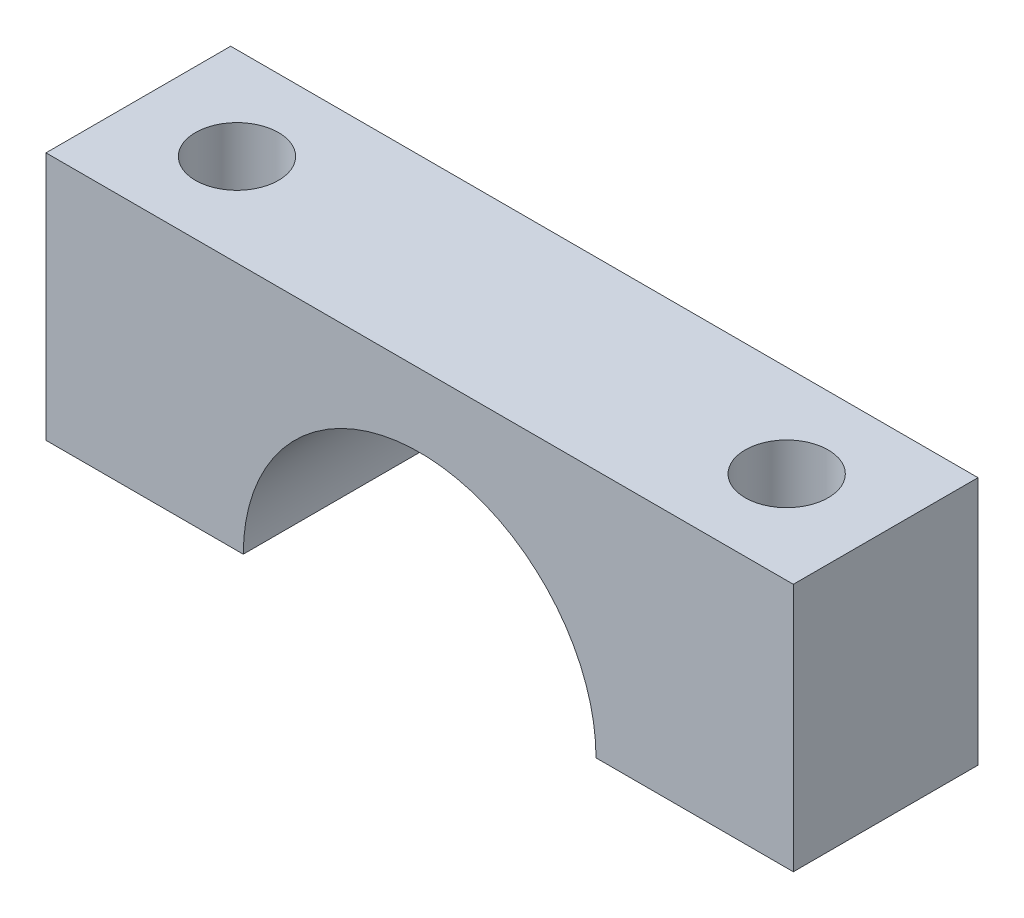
ISO-10303-21;
HEADER;
FILE_DESCRIPTION(('STEP AP214'),'2;1');
FILE_NAME('part.step','',(''),(''),'','','');
FILE_SCHEMA(('AUTOMOTIVE_DESIGN { 1 0 10303 214 1 1 1 1 }'));
ENDSEC;
DATA;
#1=APPLICATION_CONTEXT('core data for automotive mechanical design processes');
#2=APPLICATION_PROTOCOL_DEFINITION('international standard','automotive_design',2000,#1);
#3=PRODUCT_CONTEXT('',#1,'mechanical');
#4=PRODUCT('Part','Part','',(#3));
#5=PRODUCT_RELATED_PRODUCT_CATEGORY('part','',(#4));
#6=PRODUCT_DEFINITION_FORMATION('','',#4);
#7=PRODUCT_DEFINITION_CONTEXT('part definition',#1,'design');
#8=PRODUCT_DEFINITION('design','',#6,#7);
#9=PRODUCT_DEFINITION_SHAPE('','',#8);
#10=(LENGTH_UNIT() NAMED_UNIT(*) SI_UNIT(.MILLI.,.METRE.));
#11=(NAMED_UNIT(*) PLANE_ANGLE_UNIT() SI_UNIT($,.RADIAN.));
#12=(NAMED_UNIT(*) SI_UNIT($,.STERADIAN.) SOLID_ANGLE_UNIT());
#13=UNCERTAINTY_MEASURE_WITH_UNIT(LENGTH_MEASURE(1.E-05),#10,'distance_accuracy_value','');
#14=(GEOMETRIC_REPRESENTATION_CONTEXT(3) GLOBAL_UNCERTAINTY_ASSIGNED_CONTEXT((#13)) GLOBAL_UNIT_ASSIGNED_CONTEXT((#10,
#11,#12)) REPRESENTATION_CONTEXT('',''));
#15=CARTESIAN_POINT('',(0.,0.,0.));
#16=DIRECTION('',(0.,0.,1.));
#17=DIRECTION('',(1.,0.,0.));
#18=AXIS2_PLACEMENT_3D('',#15,#16,#17);
#19=CARTESIAN_POINT('',(0.,0.,44.5));
#20=DIRECTION('',(0.,1.,0.));
#21=DIRECTION('',(0.,0.,1.));
#22=AXIS2_PLACEMENT_3D('',#19,#20,#21);
#23=PLANE('',#22);
#24=CARTESIAN_POINT('',(23.77,0.,22.25));
#25=DIRECTION('',(0.,1.,0.));
#26=DIRECTION('',(0.,0.,1.));
#27=AXIS2_PLACEMENT_3D('',#24,#25,#26);
#28=CIRCLE('',#27,4.49999999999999);
#29=CARTESIAN_POINT('',(23.77,0.,26.75));
#30=VERTEX_POINT('',#29);
#31=EDGE_CURVE('E136',#30,#30,#28,.T.);
#32=ORIENTED_EDGE('',*,*,#31,.T.);
#33=EDGE_LOOP('',(#32));
#34=FACE_BOUND('',#33,.T.);
#35=DIRECTION('',(1.,0.,0.));
#36=VECTOR('',#35,1.);
#37=CARTESIAN_POINT('',(0.,0.,0.));
#38=LINE('',#37,#36);
#39=CARTESIAN_POINT('',(0.,0.,0.));
#40=VERTEX_POINT('',#39);
#41=CARTESIAN_POINT('',(47.54,0.,0.));
#42=VERTEX_POINT('',#41);
#43=EDGE_CURVE('E132',#40,#42,#38,.T.);
#44=ORIENTED_EDGE('',*,*,#43,.T.);
#45=DIRECTION('',(0.,0.,-1.));
#46=VECTOR('',#45,1.);
#47=CARTESIAN_POINT('',(47.54,0.,44.5));
#48=LINE('',#47,#46);
#49=CARTESIAN_POINT('',(47.54,0.,44.5));
#50=VERTEX_POINT('',#49);
#51=EDGE_CURVE('E11',#50,#42,#48,.T.);
#52=ORIENTED_EDGE('',*,*,#51,.F.);
#53=DIRECTION('',(1.,0.,0.));
#54=VECTOR('',#53,1.);
#55=CARTESIAN_POINT('',(0.,0.,44.5));
#56=LINE('',#55,#54);
#57=CARTESIAN_POINT('',(0.,0.,44.5));
#58=VERTEX_POINT('',#57);
#59=EDGE_CURVE('E144',#58,#50,#56,.T.);
#60=ORIENTED_EDGE('',*,*,#59,.F.);
#61=DIRECTION('',(0.,0.,-1.));
#62=VECTOR('',#61,1.);
#63=CARTESIAN_POINT('',(0.,0.,44.5));
#64=LINE('',#63,#62);
#65=EDGE_CURVE('E128',#58,#40,#64,.T.);
#66=ORIENTED_EDGE('',*,*,#65,.T.);
#67=EDGE_LOOP('',(#44,#52,#60,#66));
#68=FACE_BOUND('',#67,.T.);
#69=ADVANCED_FACE('F37',(#34,#68),#23,.F.);
#70=CARTESIAN_POINT('',(90.04,0.,44.5));
#71=DIRECTION('',(0.,0.,-1.));
#72=DIRECTION('',(-1.,0.,0.));
#73=AXIS2_PLACEMENT_3D('',#70,#71,#72);
#74=CYLINDRICAL_SURFACE('',#73,42.5);
#75=DIRECTION('',(0.,0.,-1.));
#76=VECTOR('',#75,1.);
#77=CARTESIAN_POINT('',(72.0787238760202,38.5180809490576,27.25));
#78=LINE('',#77,#76);
#79=CARTESIAN_POINT('',(72.0787238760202,38.5180809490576,27.25));
#80=VERTEX_POINT('',#79);
#81=CARTESIAN_POINT('',(72.0787238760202,38.5180809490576,17.25));
#82=VERTEX_POINT('',#81);
#83=EDGE_CURVE('E187',#80,#82,#78,.T.);
#84=ORIENTED_EDGE('',*,*,#83,.F.);
#85=CARTESIAN_POINT('',(90.04,0.,27.25));
#86=DIRECTION('',(0.,0.,-1.));
#87=DIRECTION('',(1.,0.,0.));
#88=AXIS2_PLACEMENT_3D('',#85,#86,#87);
#89=CIRCLE('',#88,42.5);
#90=CARTESIAN_POINT('',(108.00127612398,38.5180809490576,27.25));
#91=VERTEX_POINT('',#90);
#92=EDGE_CURVE('E198',#80,#91,#89,.T.);
#93=ORIENTED_EDGE('',*,*,#92,.T.);
#94=DIRECTION('',(0.,0.,-1.));
#95=VECTOR('',#94,1.);
#96=CARTESIAN_POINT('',(108.00127612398,38.5180809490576,27.25));
#97=LINE('',#96,#95);
#98=CARTESIAN_POINT('',(108.00127612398,38.5180809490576,17.25));
#99=VERTEX_POINT('',#98);
#100=EDGE_CURVE('E189',#91,#99,#97,.T.);
#101=ORIENTED_EDGE('',*,*,#100,.T.);
#102=CARTESIAN_POINT('',(90.04,0.,17.25));
#103=DIRECTION('',(0.,0.,-1.));
#104=DIRECTION('',(1.,0.,0.));
#105=AXIS2_PLACEMENT_3D('',#102,#103,#104);
#106=CIRCLE('',#105,42.5);
#107=EDGE_CURVE('E210',#82,#99,#106,.T.);
#108=ORIENTED_EDGE('',*,*,#107,.F.);
#109=EDGE_LOOP('',(#84,#93,#101,#108));
#110=FACE_BOUND('',#109,.T.);
#111=CARTESIAN_POINT('',(90.04,0.,0.));
#112=DIRECTION('',(0.,0.,-1.));
#113=DIRECTION('',(1.,0.,0.));
#114=AXIS2_PLACEMENT_3D('',#111,#112,#113);
#115=CIRCLE('',#114,42.5);
#116=CARTESIAN_POINT('',(132.54,0.,0.));
#117=VERTEX_POINT('',#116);
#118=EDGE_CURVE('E135',#42,#117,#115,.T.);
#119=ORIENTED_EDGE('',*,*,#118,.T.);
#120=DIRECTION('',(0.,0.,-1.));
#121=VECTOR('',#120,1.);
#122=CARTESIAN_POINT('',(132.54,0.,44.5));
#123=LINE('',#122,#121);
#124=CARTESIAN_POINT('',(132.54,0.,44.5));
#125=VERTEX_POINT('',#124);
#126=EDGE_CURVE('E44',#125,#117,#123,.T.);
#127=ORIENTED_EDGE('',*,*,#126,.F.);
#128=CARTESIAN_POINT('',(90.04,0.,44.5));
#129=DIRECTION('',(0.,0.,-1.));
#130=DIRECTION('',(1.,0.,0.));
#131=AXIS2_PLACEMENT_3D('',#128,#129,#130);
#132=CIRCLE('',#131,42.5);
#133=EDGE_CURVE('E95',#50,#125,#132,.T.);
#134=ORIENTED_EDGE('',*,*,#133,.F.);
#135=ORIENTED_EDGE('',*,*,#51,.T.);
#136=EDGE_LOOP('',(#119,#127,#134,#135));
#137=FACE_BOUND('',#136,.T.);
#138=ADVANCED_FACE('F243',(#110,#137),#74,.F.);
#139=CARTESIAN_POINT('',(180.08,0.,44.5));
#140=DIRECTION('',(0.,1.,0.));
#141=DIRECTION('',(-1.,0.,0.));
#142=AXIS2_PLACEMENT_3D('',#139,#140,#141);
#143=PLANE('',#142);
#144=CARTESIAN_POINT('',(156.23,0.,22.25));
#145=DIRECTION('',(0.,1.,0.));
#146=DIRECTION('',(0.,0.,1.));
#147=AXIS2_PLACEMENT_3D('',#144,#145,#146);
#148=CIRCLE('',#147,4.49999999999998);
#149=CARTESIAN_POINT('',(156.23,0.,26.75));
#150=VERTEX_POINT('',#149);
#151=EDGE_CURVE('E172',#150,#150,#148,.T.);
#152=ORIENTED_EDGE('',*,*,#151,.T.);
#153=EDGE_LOOP('',(#152));
#154=FACE_BOUND('',#153,.T.);
#155=DIRECTION('',(1.,0.,0.));
#156=VECTOR('',#155,1.);
#157=CARTESIAN_POINT('',(180.08,0.,0.));
#158=LINE('',#157,#156);
#159=CARTESIAN_POINT('',(180.08,0.,0.));
#160=VERTEX_POINT('',#159);
#161=EDGE_CURVE('E138',#117,#160,#158,.T.);
#162=ORIENTED_EDGE('',*,*,#161,.T.);
#163=DIRECTION('',(0.,0.,-1.));
#164=VECTOR('',#163,1.);
#165=CARTESIAN_POINT('',(180.08,0.,44.5));
#166=LINE('',#165,#164);
#167=CARTESIAN_POINT('',(180.08,0.,44.5));
#168=VERTEX_POINT('',#167);
#169=EDGE_CURVE('E123',#168,#160,#166,.T.);
#170=ORIENTED_EDGE('',*,*,#169,.F.);
#171=DIRECTION('',(1.,0.,0.));
#172=VECTOR('',#171,1.);
#173=CARTESIAN_POINT('',(180.08,0.,44.5));
#174=LINE('',#173,#172);
#175=EDGE_CURVE('E111',#125,#168,#174,.T.);
#176=ORIENTED_EDGE('',*,*,#175,.F.);
#177=ORIENTED_EDGE('',*,*,#126,.T.);
#178=EDGE_LOOP('',(#162,#170,#176,#177));
#179=FACE_BOUND('',#178,.T.);
#180=ADVANCED_FACE('F150',(#154,#179),#143,.F.);
#181=CARTESIAN_POINT('',(180.08,60.,44.5));
#182=DIRECTION('',(-1.,0.,0.));
#183=DIRECTION('',(0.,0.,1.));
#184=AXIS2_PLACEMENT_3D('',#181,#182,#183);
#185=PLANE('',#184);
#186=DIRECTION('',(0.,1.,0.));
#187=VECTOR('',#186,1.);
#188=CARTESIAN_POINT('',(180.08,60.,0.));
#189=LINE('',#188,#187);
#190=CARTESIAN_POINT('',(180.08,60.,0.));
#191=VERTEX_POINT('',#190);
#192=EDGE_CURVE('E120',#160,#191,#189,.T.);
#193=ORIENTED_EDGE('',*,*,#192,.T.);
#194=DIRECTION('',(0.,0.,-1.));
#195=VECTOR('',#194,1.);
#196=CARTESIAN_POINT('',(180.08,60.,44.5));
#197=LINE('',#196,#195);
#198=CARTESIAN_POINT('',(180.08,60.,44.5));
#199=VERTEX_POINT('',#198);
#200=EDGE_CURVE('E117',#199,#191,#197,.T.);
#201=ORIENTED_EDGE('',*,*,#200,.F.);
#202=DIRECTION('',(0.,1.,0.));
#203=VECTOR('',#202,1.);
#204=CARTESIAN_POINT('',(180.08,60.,44.5));
#205=LINE('',#204,#203);
#206=EDGE_CURVE('E104',#168,#199,#205,.T.);
#207=ORIENTED_EDGE('',*,*,#206,.F.);
#208=ORIENTED_EDGE('',*,*,#169,.T.);
#209=EDGE_LOOP('',(#193,#201,#207,#208));
#210=FACE_BOUND('',#209,.T.);
#211=ADVANCED_FACE('F118',(#210),#185,.F.);
#212=CARTESIAN_POINT('',(0.,60.,44.5));
#213=DIRECTION('',(0.,-1.,0.));
#214=DIRECTION('',(0.,0.,-1.));
#215=AXIS2_PLACEMENT_3D('',#212,#213,#214);
#216=PLANE('',#215);
#217=CARTESIAN_POINT('',(156.23,60.,22.25));
#218=DIRECTION('',(0.,1.,0.));
#219=DIRECTION('',(0.,0.,1.));
#220=AXIS2_PLACEMENT_3D('',#217,#218,#219);
#221=CIRCLE('',#220,10.);
#222=CARTESIAN_POINT('',(156.23,60.,32.25));
#223=VERTEX_POINT('',#222);
#224=EDGE_CURVE('E181',#223,#223,#221,.T.);
#225=ORIENTED_EDGE('',*,*,#224,.F.);
#226=EDGE_LOOP('',(#225));
#227=FACE_BOUND('',#226,.T.);
#228=CARTESIAN_POINT('',(23.77,60.,22.25));
#229=DIRECTION('',(0.,1.,0.));
#230=DIRECTION('',(0.,0.,1.));
#231=AXIS2_PLACEMENT_3D('',#228,#229,#230);
#232=CIRCLE('',#231,10.);
#233=CARTESIAN_POINT('',(23.77,60.,32.25));
#234=VERTEX_POINT('',#233);
#235=EDGE_CURVE('E169',#234,#234,#232,.T.);
#236=ORIENTED_EDGE('',*,*,#235,.F.);
#237=EDGE_LOOP('',(#236));
#238=FACE_BOUND('',#237,.T.);
#239=DIRECTION('',(-1.,0.,0.));
#240=VECTOR('',#239,1.);
#241=CARTESIAN_POINT('',(0.,60.,0.));
#242=LINE('',#241,#240);
#243=CARTESIAN_POINT('',(0.,60.,0.));
#244=VERTEX_POINT('',#243);
#245=EDGE_CURVE('E141',#191,#244,#242,.T.);
#246=ORIENTED_EDGE('',*,*,#245,.T.);
#247=DIRECTION('',(0.,0.,-1.));
#248=VECTOR('',#247,1.);
#249=CARTESIAN_POINT('',(0.,60.,44.5));
#250=LINE('',#249,#248);
#251=CARTESIAN_POINT('',(0.,60.,44.5));
#252=VERTEX_POINT('',#251);
#253=EDGE_CURVE('E124',#252,#244,#250,.T.);
#254=ORIENTED_EDGE('',*,*,#253,.F.);
#255=DIRECTION('',(-1.,0.,0.));
#256=VECTOR('',#255,1.);
#257=CARTESIAN_POINT('',(0.,60.,44.5));
#258=LINE('',#257,#256);
#259=EDGE_CURVE('E108',#199,#252,#258,.T.);
#260=ORIENTED_EDGE('',*,*,#259,.F.);
#261=ORIENTED_EDGE('',*,*,#200,.T.);
#262=EDGE_LOOP('',(#246,#254,#260,#261));
#263=FACE_BOUND('',#262,.T.);
#264=ADVANCED_FACE('F126',(#227,#238,#263),#216,.F.);
#265=CARTESIAN_POINT('',(0.,0.,44.5));
#266=DIRECTION('',(1.,0.,0.));
#267=DIRECTION('',(0.,0.,-1.));
#268=AXIS2_PLACEMENT_3D('',#265,#266,#267);
#269=PLANE('',#268);
#270=DIRECTION('',(0.,-1.,0.));
#271=VECTOR('',#270,1.);
#272=CARTESIAN_POINT('',(0.,0.,0.));
#273=LINE('',#272,#271);
#274=EDGE_CURVE('E87',#244,#40,#273,.T.);
#275=ORIENTED_EDGE('',*,*,#274,.T.);
#276=ORIENTED_EDGE('',*,*,#65,.F.);
#277=DIRECTION('',(0.,-1.,0.));
#278=VECTOR('',#277,1.);
#279=CARTESIAN_POINT('',(0.,0.,44.5));
#280=LINE('',#279,#278);
#281=EDGE_CURVE('E60',#252,#58,#280,.T.);
#282=ORIENTED_EDGE('',*,*,#281,.F.);
#283=ORIENTED_EDGE('',*,*,#253,.T.);
#284=EDGE_LOOP('',(#275,#276,#282,#283));
#285=FACE_BOUND('',#284,.T.);
#286=ADVANCED_FACE('F154',(#285),#269,.F.);
#287=CARTESIAN_POINT('',(90.04,0.,44.5));
#288=DIRECTION('',(0.,0.,1.));
#289=DIRECTION('',(1.,0.,0.));
#290=AXIS2_PLACEMENT_3D('',#287,#288,#289);
#291=PLANE('',#290);
#292=ORIENTED_EDGE('',*,*,#59,.T.);
#293=ORIENTED_EDGE('',*,*,#133,.T.);
#294=ORIENTED_EDGE('',*,*,#175,.T.);
#295=ORIENTED_EDGE('',*,*,#206,.T.);
#296=ORIENTED_EDGE('',*,*,#259,.T.);
#297=ORIENTED_EDGE('',*,*,#281,.T.);
#298=EDGE_LOOP('',(#292,#293,#294,#295,#296,#297));
#299=FACE_BOUND('',#298,.T.);
#300=ADVANCED_FACE('F106',(#299),#291,.T.);
#301=CARTESIAN_POINT('',(90.04,0.,0.));
#302=DIRECTION('',(0.,0.,1.));
#303=DIRECTION('',(1.,0.,0.));
#304=AXIS2_PLACEMENT_3D('',#301,#302,#303);
#305=PLANE('',#304);
#306=ORIENTED_EDGE('',*,*,#43,.F.);
#307=ORIENTED_EDGE('',*,*,#274,.F.);
#308=ORIENTED_EDGE('',*,*,#245,.F.);
#309=ORIENTED_EDGE('',*,*,#192,.F.);
#310=ORIENTED_EDGE('',*,*,#161,.F.);
#311=ORIENTED_EDGE('',*,*,#118,.F.);
#312=EDGE_LOOP('',(#306,#307,#308,#309,#310,#311));
#313=FACE_BOUND('',#312,.T.);
#314=ADVANCED_FACE('F153',(#313),#305,.F.);
#315=CARTESIAN_POINT('',(23.77,60.,22.25));
#316=DIRECTION('',(0.,1.,0.));
#317=DIRECTION('',(0.,0.,1.));
#318=AXIS2_PLACEMENT_3D('',#315,#316,#317);
#319=CYLINDRICAL_SURFACE('',#318,4.49999999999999);
#320=ORIENTED_EDGE('',*,*,#31,.F.);
#321=EDGE_LOOP('',(#320));
#322=FACE_BOUND('',#321,.T.);
#323=CARTESIAN_POINT('',(23.77,42.,22.25));
#324=DIRECTION('',(0.,1.,0.));
#325=DIRECTION('',(0.,0.,1.));
#326=AXIS2_PLACEMENT_3D('',#323,#324,#325);
#327=CIRCLE('',#326,4.5);
#328=CARTESIAN_POINT('',(23.77,42.,26.75));
#329=VERTEX_POINT('',#328);
#330=EDGE_CURVE('E163',#329,#329,#327,.T.);
#331=ORIENTED_EDGE('',*,*,#330,.T.);
#332=EDGE_LOOP('',(#331));
#333=FACE_BOUND('',#332,.T.);
#334=ADVANCED_FACE('F263',(#322,#333),#319,.F.);
#335=CARTESIAN_POINT('',(28.27,42.,22.25));
#336=DIRECTION('',(0.,-1.,0.));
#337=DIRECTION('',(0.,0.,-1.));
#338=AXIS2_PLACEMENT_3D('',#335,#336,#337);
#339=PLANE('',#338);
#340=ORIENTED_EDGE('',*,*,#330,.F.);
#341=EDGE_LOOP('',(#340));
#342=FACE_BOUND('',#341,.T.);
#343=CARTESIAN_POINT('',(23.77,42.,22.25));
#344=DIRECTION('',(0.,1.,0.));
#345=DIRECTION('',(0.,0.,1.));
#346=AXIS2_PLACEMENT_3D('',#343,#344,#345);
#347=CIRCLE('',#346,10.);
#348=CARTESIAN_POINT('',(23.77,42.,32.25));
#349=VERTEX_POINT('',#348);
#350=EDGE_CURVE('E166',#349,#349,#347,.T.);
#351=ORIENTED_EDGE('',*,*,#350,.T.);
#352=EDGE_LOOP('',(#351));
#353=FACE_BOUND('',#352,.T.);
#354=ADVANCED_FACE('F266',(#342,#353),#339,.F.);
#355=CARTESIAN_POINT('',(23.77,60.,22.25));
#356=DIRECTION('',(0.,1.,0.));
#357=DIRECTION('',(0.,0.,1.));
#358=AXIS2_PLACEMENT_3D('',#355,#356,#357);
#359=CYLINDRICAL_SURFACE('',#358,10.);
#360=ORIENTED_EDGE('',*,*,#350,.F.);
#361=EDGE_LOOP('',(#360));
#362=FACE_BOUND('',#361,.T.);
#363=ORIENTED_EDGE('',*,*,#235,.T.);
#364=EDGE_LOOP('',(#363));
#365=FACE_BOUND('',#364,.T.);
#366=ADVANCED_FACE('F272',(#362,#365),#359,.F.);
#367=CARTESIAN_POINT('',(156.23,60.,22.25));
#368=DIRECTION('',(0.,1.,0.));
#369=DIRECTION('',(0.,0.,1.));
#370=AXIS2_PLACEMENT_3D('',#367,#368,#369);
#371=CYLINDRICAL_SURFACE('',#370,4.49999999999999);
#372=ORIENTED_EDGE('',*,*,#151,.F.);
#373=EDGE_LOOP('',(#372));
#374=FACE_BOUND('',#373,.T.);
#375=CARTESIAN_POINT('',(156.23,42.,22.25));
#376=DIRECTION('',(0.,1.,0.));
#377=DIRECTION('',(0.,0.,1.));
#378=AXIS2_PLACEMENT_3D('',#375,#376,#377);
#379=CIRCLE('',#378,4.5);
#380=CARTESIAN_POINT('',(156.23,42.,26.75));
#381=VERTEX_POINT('',#380);
#382=EDGE_CURVE('E175',#381,#381,#379,.T.);
#383=ORIENTED_EDGE('',*,*,#382,.T.);
#384=EDGE_LOOP('',(#383));
#385=FACE_BOUND('',#384,.T.);
#386=ADVANCED_FACE('F278',(#374,#385),#371,.F.);
#387=CARTESIAN_POINT('',(160.73,42.,22.25));
#388=DIRECTION('',(0.,-1.,0.));
#389=DIRECTION('',(0.,0.,-1.));
#390=AXIS2_PLACEMENT_3D('',#387,#388,#389);
#391=PLANE('',#390);
#392=ORIENTED_EDGE('',*,*,#382,.F.);
#393=EDGE_LOOP('',(#392));
#394=FACE_BOUND('',#393,.T.);
#395=CARTESIAN_POINT('',(156.23,42.,22.25));
#396=DIRECTION('',(0.,1.,0.));
#397=DIRECTION('',(0.,0.,1.));
#398=AXIS2_PLACEMENT_3D('',#395,#396,#397);
#399=CIRCLE('',#398,10.);
#400=CARTESIAN_POINT('',(156.23,42.,32.25));
#401=VERTEX_POINT('',#400);
#402=EDGE_CURVE('E178',#401,#401,#399,.T.);
#403=ORIENTED_EDGE('',*,*,#402,.T.);
#404=EDGE_LOOP('',(#403));
#405=FACE_BOUND('',#404,.T.);
#406=ADVANCED_FACE('F302',(#394,#405),#391,.F.);
#407=CARTESIAN_POINT('',(156.23,60.,22.25));
#408=DIRECTION('',(0.,1.,0.));
#409=DIRECTION('',(0.,0.,1.));
#410=AXIS2_PLACEMENT_3D('',#407,#408,#409);
#411=CYLINDRICAL_SURFACE('',#410,10.);
#412=ORIENTED_EDGE('',*,*,#402,.F.);
#413=EDGE_LOOP('',(#412));
#414=FACE_BOUND('',#413,.T.);
#415=ORIENTED_EDGE('',*,*,#224,.T.);
#416=EDGE_LOOP('',(#415));
#417=FACE_BOUND('',#416,.T.);
#418=ADVANCED_FACE('F254',(#414,#417),#411,.F.);
#419=CARTESIAN_POINT('',(90.04,0.,27.25));
#420=DIRECTION('',(0.,0.,-1.));
#421=DIRECTION('',(-1.,0.,0.));
#422=AXIS2_PLACEMENT_3D('',#419,#420,#421);
#423=CYLINDRICAL_SURFACE('',#422,44.);
#424=DIRECTION('',(0.,0.,-1.));
#425=VECTOR('',#424,1.);
#426=CARTESIAN_POINT('',(108.635203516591,39.8775426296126,27.25));
#427=LINE('',#426,#425);
#428=CARTESIAN_POINT('',(108.635203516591,39.8775426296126,27.25));
#429=VERTEX_POINT('',#428);
#430=CARTESIAN_POINT('',(108.635203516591,39.8775426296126,17.25));
#431=VERTEX_POINT('',#430);
#432=EDGE_CURVE('E192',#429,#431,#427,.T.);
#433=ORIENTED_EDGE('',*,*,#432,.F.);
#434=CARTESIAN_POINT('',(90.04,0.,27.25));
#435=DIRECTION('',(0.,0.,1.));
#436=DIRECTION('',(1.,0.,0.));
#437=AXIS2_PLACEMENT_3D('',#434,#435,#436);
#438=CIRCLE('',#437,44.);
#439=CARTESIAN_POINT('',(71.4447964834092,39.8775426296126,27.25));
#440=VERTEX_POINT('',#439);
#441=EDGE_CURVE('E204',#429,#440,#438,.T.);
#442=ORIENTED_EDGE('',*,*,#441,.T.);
#443=DIRECTION('',(0.,0.,-1.));
#444=VECTOR('',#443,1.);
#445=CARTESIAN_POINT('',(71.4447964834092,39.8775426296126,27.25));
#446=LINE('',#445,#444);
#447=CARTESIAN_POINT('',(71.4447964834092,39.8775426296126,17.25));
#448=VERTEX_POINT('',#447);
#449=EDGE_CURVE('E184',#440,#448,#446,.T.);
#450=ORIENTED_EDGE('',*,*,#449,.T.);
#451=CARTESIAN_POINT('',(90.04,0.,17.25));
#452=DIRECTION('',(0.,0.,1.));
#453=DIRECTION('',(1.,0.,0.));
#454=AXIS2_PLACEMENT_3D('',#451,#452,#453);
#455=CIRCLE('',#454,44.);
#456=EDGE_CURVE('E213',#431,#448,#455,.T.);
#457=ORIENTED_EDGE('',*,*,#456,.F.);
#458=EDGE_LOOP('',(#433,#442,#450,#457));
#459=FACE_BOUND('',#458,.T.);
#460=ADVANCED_FACE('F223',(#459),#423,.F.);
#461=CARTESIAN_POINT('',(71.4447964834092,39.8775426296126,27.25));
#462=DIRECTION('',(0.906307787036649,0.422618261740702,0.));
#463=DIRECTION('',(-0.422618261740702,0.906307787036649,0.));
#464=AXIS2_PLACEMENT_3D('',#461,#462,#463);
#465=PLANE('',#464);
#466=ORIENTED_EDGE('',*,*,#449,.F.);
#467=DIRECTION('',(0.422618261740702,-0.906307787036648,0.));
#468=VECTOR('',#467,1.);
#469=CARTESIAN_POINT('',(71.4447964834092,39.8775426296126,27.25));
#470=LINE('',#469,#468);
#471=EDGE_CURVE('E201',#440,#80,#470,.T.);
#472=ORIENTED_EDGE('',*,*,#471,.T.);
#473=ORIENTED_EDGE('',*,*,#83,.T.);
#474=DIRECTION('',(0.422618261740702,-0.906307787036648,0.));
#475=VECTOR('',#474,1.);
#476=CARTESIAN_POINT('',(71.4447964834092,39.8775426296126,17.25));
#477=LINE('',#476,#475);
#478=EDGE_CURVE('E51',#448,#82,#477,.T.);
#479=ORIENTED_EDGE('',*,*,#478,.F.);
#480=EDGE_LOOP('',(#466,#472,#473,#479));
#481=FACE_BOUND('',#480,.T.);
#482=ADVANCED_FACE('F246',(#481),#465,.T.);
#483=CARTESIAN_POINT('',(108.635203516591,39.8775426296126,27.25));
#484=DIRECTION('',(-0.906307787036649,0.422618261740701,0.));
#485=DIRECTION('',(-0.422618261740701,-0.906307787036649,0.));
#486=AXIS2_PLACEMENT_3D('',#483,#484,#485);
#487=PLANE('',#486);
#488=ORIENTED_EDGE('',*,*,#100,.F.);
#489=DIRECTION('',(0.422618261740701,0.906307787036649,0.));
#490=VECTOR('',#489,1.);
#491=CARTESIAN_POINT('',(108.635203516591,39.8775426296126,27.25));
#492=LINE('',#491,#490);
#493=EDGE_CURVE('E195',#91,#429,#492,.T.);
#494=ORIENTED_EDGE('',*,*,#493,.T.);
#495=ORIENTED_EDGE('',*,*,#432,.T.);
#496=DIRECTION('',(0.422618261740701,0.906307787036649,0.));
#497=VECTOR('',#496,1.);
#498=CARTESIAN_POINT('',(108.635203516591,39.8775426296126,17.25));
#499=LINE('',#498,#497);
#500=EDGE_CURVE('E207',#99,#431,#499,.T.);
#501=ORIENTED_EDGE('',*,*,#500,.F.);
#502=EDGE_LOOP('',(#488,#494,#495,#501));
#503=FACE_BOUND('',#502,.T.);
#504=ADVANCED_FACE('F237',(#503),#487,.T.);
#505=CARTESIAN_POINT('',(90.04,0.,27.25));
#506=DIRECTION('',(0.,0.,1.));
#507=DIRECTION('',(1.,0.,0.));
#508=AXIS2_PLACEMENT_3D('',#505,#506,#507);
#509=PLANE('',#508);
#510=ORIENTED_EDGE('',*,*,#441,.F.);
#511=ORIENTED_EDGE('',*,*,#493,.F.);
#512=ORIENTED_EDGE('',*,*,#92,.F.);
#513=ORIENTED_EDGE('',*,*,#471,.F.);
#514=EDGE_LOOP('',(#510,#511,#512,#513));
#515=FACE_BOUND('',#514,.T.);
#516=ADVANCED_FACE('F240',(#515),#509,.F.);
#517=CARTESIAN_POINT('',(90.04,0.,17.25));
#518=DIRECTION('',(0.,0.,1.));
#519=DIRECTION('',(1.,0.,0.));
#520=AXIS2_PLACEMENT_3D('',#517,#518,#519);
#521=PLANE('',#520);
#522=ORIENTED_EDGE('',*,*,#456,.T.);
#523=ORIENTED_EDGE('',*,*,#478,.T.);
#524=ORIENTED_EDGE('',*,*,#107,.T.);
#525=ORIENTED_EDGE('',*,*,#500,.T.);
#526=EDGE_LOOP('',(#522,#523,#524,#525));
#527=FACE_BOUND('',#526,.T.);
#528=ADVANCED_FACE('F216',(#527),#521,.T.);
#529=CLOSED_SHELL('',(#69,#138,#180,#211,#264,#286,#300,#314,#334,#354,#366,#386,#406,#418,#460,
#482,#504,#516,#528));
#530=MANIFOLD_SOLID_BREP('B2',#529);
#531=ADVANCED_BREP_SHAPE_REPRESENTATION('',(#18,#530),#14);
#532=SHAPE_DEFINITION_REPRESENTATION(#9,#531);
ENDSEC;
END-ISO-10303-21;
